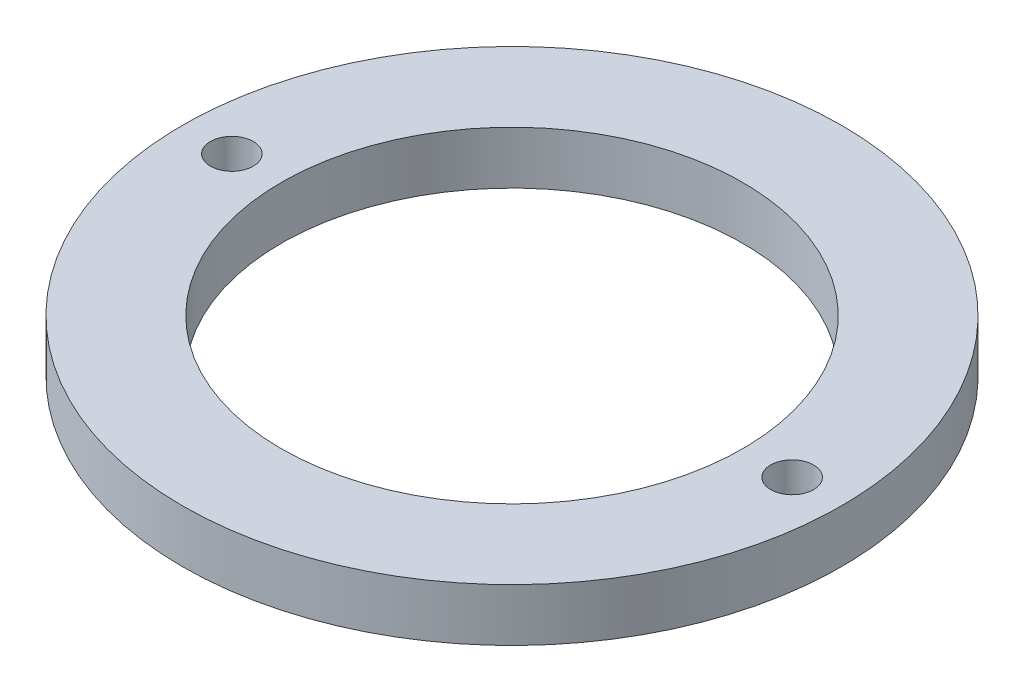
ISO-10303-21;
HEADER;
FILE_DESCRIPTION(('STEP AP214'),'2;1');
FILE_NAME('part.step','',(''),(''),'','','');
FILE_SCHEMA(('AUTOMOTIVE_DESIGN { 1 0 10303 214 1 1 1 1 }'));
ENDSEC;
DATA;
#1=APPLICATION_CONTEXT('core data for automotive mechanical design processes');
#2=APPLICATION_PROTOCOL_DEFINITION('international standard','automotive_design',2000,#1);
#3=PRODUCT_CONTEXT('',#1,'mechanical');
#4=PRODUCT('Part','Part','',(#3));
#5=PRODUCT_RELATED_PRODUCT_CATEGORY('part','',(#4));
#6=PRODUCT_DEFINITION_FORMATION('','',#4);
#7=PRODUCT_DEFINITION_CONTEXT('part definition',#1,'design');
#8=PRODUCT_DEFINITION('design','',#6,#7);
#9=PRODUCT_DEFINITION_SHAPE('','',#8);
#10=(LENGTH_UNIT() NAMED_UNIT(*) SI_UNIT(.MILLI.,.METRE.));
#11=(NAMED_UNIT(*) PLANE_ANGLE_UNIT() SI_UNIT($,.RADIAN.));
#12=(NAMED_UNIT(*) SI_UNIT($,.STERADIAN.) SOLID_ANGLE_UNIT());
#13=UNCERTAINTY_MEASURE_WITH_UNIT(LENGTH_MEASURE(1.E-05),#10,'distance_accuracy_value','');
#14=(GEOMETRIC_REPRESENTATION_CONTEXT(3) GLOBAL_UNCERTAINTY_ASSIGNED_CONTEXT((#13)) GLOBAL_UNIT_ASSIGNED_CONTEXT((#10,
#11,#12)) REPRESENTATION_CONTEXT('',''));
#15=CARTESIAN_POINT('',(0.,0.,0.));
#16=DIRECTION('',(0.,0.,1.));
#17=DIRECTION('',(1.,0.,0.));
#18=AXIS2_PLACEMENT_3D('',#15,#16,#17);
#19=CARTESIAN_POINT('',(0.,8.,0.));
#20=DIRECTION('',(0.,1.,0.));
#21=DIRECTION('',(0.,0.,1.));
#22=AXIS2_PLACEMENT_3D('',#19,#20,#21);
#23=PLANE('',#22);
#24=CARTESIAN_POINT('',(-42.5,8.,0.));
#25=DIRECTION('',(0.,1.,0.));
#26=DIRECTION('',(0.,0.,1.));
#27=AXIS2_PLACEMENT_3D('',#24,#25,#26);
#28=CIRCLE('',#27,3.25);
#29=CARTESIAN_POINT('',(-42.5,8.,3.25));
#30=VERTEX_POINT('',#29);
#31=EDGE_CURVE('E30',#30,#30,#28,.T.);
#32=ORIENTED_EDGE('',*,*,#31,.F.);
#33=EDGE_LOOP('',(#32));
#34=FACE_BOUND('',#33,.T.);
#35=CARTESIAN_POINT('',(0.,8.,0.));
#36=DIRECTION('',(0.,1.,0.));
#37=DIRECTION('',(0.,0.,1.));
#38=AXIS2_PLACEMENT_3D('',#35,#36,#37);
#39=CIRCLE('',#38,50.);
#40=CARTESIAN_POINT('',(0.,8.,50.));
#41=VERTEX_POINT('',#40);
#42=EDGE_CURVE('E9',#41,#41,#39,.T.);
#43=ORIENTED_EDGE('',*,*,#42,.T.);
#44=EDGE_LOOP('',(#43));
#45=FACE_BOUND('',#44,.T.);
#46=CARTESIAN_POINT('',(0.,8.,0.));
#47=DIRECTION('',(0.,1.,0.));
#48=DIRECTION('',(0.,0.,1.));
#49=AXIS2_PLACEMENT_3D('',#46,#47,#48);
#50=CIRCLE('',#49,35.);
#51=CARTESIAN_POINT('',(0.,8.,35.));
#52=VERTEX_POINT('',#51);
#53=EDGE_CURVE('E25',#52,#52,#50,.T.);
#54=ORIENTED_EDGE('',*,*,#53,.F.);
#55=EDGE_LOOP('',(#54));
#56=FACE_BOUND('',#55,.T.);
#57=CARTESIAN_POINT('',(42.5,8.,0.));
#58=DIRECTION('',(0.,1.,0.));
#59=DIRECTION('',(0.,0.,1.));
#60=AXIS2_PLACEMENT_3D('',#57,#58,#59);
#61=CIRCLE('',#60,3.25);
#62=CARTESIAN_POINT('',(42.5,8.,3.25));
#63=VERTEX_POINT('',#62);
#64=EDGE_CURVE('E36',#63,#63,#61,.T.);
#65=ORIENTED_EDGE('',*,*,#64,.F.);
#66=EDGE_LOOP('',(#65));
#67=FACE_BOUND('',#66,.T.);
#68=ADVANCED_FACE('F14',(#34,#45,#56,#67),#23,.T.);
#69=CARTESIAN_POINT('',(0.,0.,0.));
#70=DIRECTION('',(0.,1.,0.));
#71=DIRECTION('',(0.,0.,1.));
#72=AXIS2_PLACEMENT_3D('',#69,#70,#71);
#73=PLANE('',#72);
#74=CARTESIAN_POINT('',(0.,0.,0.));
#75=DIRECTION('',(0.,1.,0.));
#76=DIRECTION('',(0.,0.,1.));
#77=AXIS2_PLACEMENT_3D('',#74,#75,#76);
#78=CIRCLE('',#77,50.);
#79=CARTESIAN_POINT('',(0.,0.,50.));
#80=VERTEX_POINT('',#79);
#81=EDGE_CURVE('E18',#80,#80,#78,.T.);
#82=ORIENTED_EDGE('',*,*,#81,.F.);
#83=EDGE_LOOP('',(#82));
#84=FACE_BOUND('',#83,.T.);
#85=CARTESIAN_POINT('',(0.,0.,0.));
#86=DIRECTION('',(0.,1.,0.));
#87=DIRECTION('',(0.,0.,1.));
#88=AXIS2_PLACEMENT_3D('',#85,#86,#87);
#89=CIRCLE('',#88,35.);
#90=CARTESIAN_POINT('',(0.,0.,35.));
#91=VERTEX_POINT('',#90);
#92=EDGE_CURVE('E27',#91,#91,#89,.T.);
#93=ORIENTED_EDGE('',*,*,#92,.T.);
#94=EDGE_LOOP('',(#93));
#95=FACE_BOUND('',#94,.T.);
#96=CARTESIAN_POINT('',(-42.5,0.,0.));
#97=DIRECTION('',(0.,1.,0.));
#98=DIRECTION('',(0.,0.,1.));
#99=AXIS2_PLACEMENT_3D('',#96,#97,#98);
#100=CIRCLE('',#99,3.25);
#101=CARTESIAN_POINT('',(-42.5,0.,3.25));
#102=VERTEX_POINT('',#101);
#103=EDGE_CURVE('E33',#102,#102,#100,.T.);
#104=ORIENTED_EDGE('',*,*,#103,.T.);
#105=EDGE_LOOP('',(#104));
#106=FACE_BOUND('',#105,.T.);
#107=CARTESIAN_POINT('',(42.5,0.,0.));
#108=DIRECTION('',(0.,1.,0.));
#109=DIRECTION('',(0.,0.,1.));
#110=AXIS2_PLACEMENT_3D('',#107,#108,#109);
#111=CIRCLE('',#110,3.25);
#112=CARTESIAN_POINT('',(42.5,0.,3.25));
#113=VERTEX_POINT('',#112);
#114=EDGE_CURVE('E39',#113,#113,#111,.T.);
#115=ORIENTED_EDGE('',*,*,#114,.T.);
#116=EDGE_LOOP('',(#115));
#117=FACE_BOUND('',#116,.T.);
#118=ADVANCED_FACE('F49',(#84,#95,#106,#117),#73,.F.);
#119=CARTESIAN_POINT('',(0.,8.,0.));
#120=DIRECTION('',(0.,-1.,0.));
#121=DIRECTION('',(0.,0.,-1.));
#122=AXIS2_PLACEMENT_3D('',#119,#120,#121);
#123=CYLINDRICAL_SURFACE('',#122,50.);
#124=ORIENTED_EDGE('',*,*,#42,.F.);
#125=EDGE_LOOP('',(#124));
#126=FACE_BOUND('',#125,.T.);
#127=ORIENTED_EDGE('',*,*,#81,.T.);
#128=EDGE_LOOP('',(#127));
#129=FACE_BOUND('',#128,.T.);
#130=ADVANCED_FACE('F16',(#126,#129),#123,.T.);
#131=CARTESIAN_POINT('',(0.,8.,0.));
#132=DIRECTION('',(0.,-1.,0.));
#133=DIRECTION('',(0.,0.,-1.));
#134=AXIS2_PLACEMENT_3D('',#131,#132,#133);
#135=CYLINDRICAL_SURFACE('',#134,35.);
#136=ORIENTED_EDGE('',*,*,#53,.T.);
#137=EDGE_LOOP('',(#136));
#138=FACE_BOUND('',#137,.T.);
#139=ORIENTED_EDGE('',*,*,#92,.F.);
#140=EDGE_LOOP('',(#139));
#141=FACE_BOUND('',#140,.T.);
#142=ADVANCED_FACE('F60',(#138,#141),#135,.F.);
#143=CARTESIAN_POINT('',(-42.5,8.,0.));
#144=DIRECTION('',(0.,-1.,0.));
#145=DIRECTION('',(0.,0.,-1.));
#146=AXIS2_PLACEMENT_3D('',#143,#144,#145);
#147=CYLINDRICAL_SURFACE('',#146,3.25);
#148=ORIENTED_EDGE('',*,*,#31,.T.);
#149=EDGE_LOOP('',(#148));
#150=FACE_BOUND('',#149,.T.);
#151=ORIENTED_EDGE('',*,*,#103,.F.);
#152=EDGE_LOOP('',(#151));
#153=FACE_BOUND('',#152,.T.);
#154=ADVANCED_FACE('F63',(#150,#153),#147,.F.);
#155=CARTESIAN_POINT('',(42.5,8.,0.));
#156=DIRECTION('',(0.,-1.,0.));
#157=DIRECTION('',(0.,0.,-1.));
#158=AXIS2_PLACEMENT_3D('',#155,#156,#157);
#159=CYLINDRICAL_SURFACE('',#158,3.25);
#160=ORIENTED_EDGE('',*,*,#64,.T.);
#161=EDGE_LOOP('',(#160));
#162=FACE_BOUND('',#161,.T.);
#163=ORIENTED_EDGE('',*,*,#114,.F.);
#164=EDGE_LOOP('',(#163));
#165=FACE_BOUND('',#164,.T.);
#166=ADVANCED_FACE('F45',(#162,#165),#159,.F.);
#167=CLOSED_SHELL('',(#68,#118,#130,#142,#154,#166));
#168=MANIFOLD_SOLID_BREP('B1',#167);
#169=ADVANCED_BREP_SHAPE_REPRESENTATION('',(#18,#168),#14);
#170=SHAPE_DEFINITION_REPRESENTATION(#9,#169);
ENDSEC;
END-ISO-10303-21;
